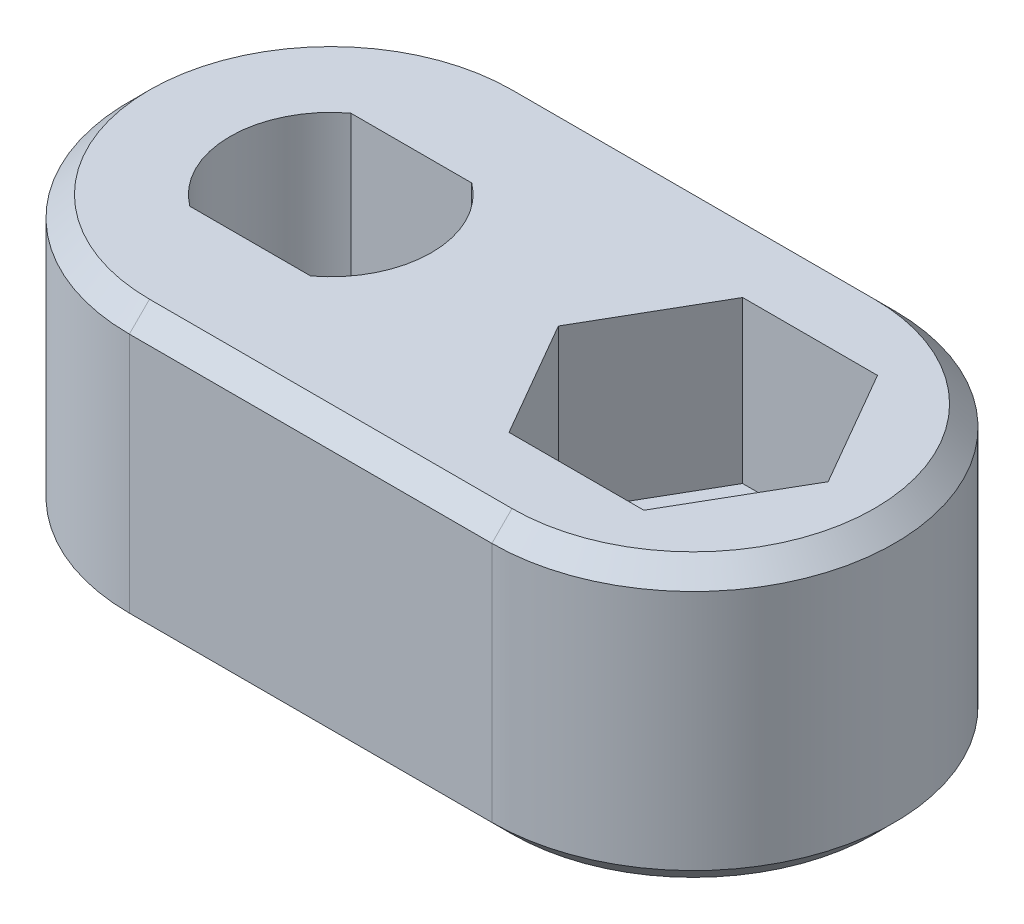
from build123d import *

# Parameters (mm, degrees)
EXTRUDE_1_DEPTH              = 7
CUT_EXTRUDE_1_DEPTH          = 4
HOLE_WIZARD_M3_1_D           = 3.4
HOLE_WIZARD_M3_1_DEPTH       = 7.5
HOLE_WIZARD_M3_1_CSINK_D     = 6.72
HOLE_WIZARD_M3_1_CSINK_ANGLE = 90
HOLE_WIZARD_M3_1_TIP         = 1.021463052
HOLE_WIZARD_1_D              = 4.15
CUT_EXTRUDE_2_DEPTH          = 4
CHAMFER_1_SIZE               = 0.5


with BuildPart() as part:
    # Sketch 1 → Extrude 1 (new body)
    with BuildSketch(Plane(origin=(0, 0, 0), x_dir=(1, 0, 0), z_dir=(0, 1, 0))):
        with BuildLine():
            Line((0, 5), (9, 5))
            ThreePointArc((9, 5), (14, 0), (9, -5))
            Line((9, -5), (0, -5))
            ThreePointArc((0, -5), (-5, 0), (0, 5))
        make_face()
    extrude(amount=EXTRUDE_1_DEPTH)

    # Sketch 2 → Cut-Extrude 1 (cut)
    with BuildSketch(Plane(origin=(0, 7, 0), x_dir=(1, 0, 0), z_dir=(0, 1, 0))):
        with BuildLine():
            ThreePointArc((-1.5, 2), (-2.5, 0), (-1.5, -2))
            Line((-1.5, -2), (1.5, -2))
            ThreePointArc((1.5, -2), (2.236067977, -1.118033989), (2.5, 0))
            ThreePointArc((2.5, 0), (2.236067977, 1.118033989), (1.5, 2))
            Line((1.5, 2), (-1.5, 2))
        make_face()
    extrude(amount=-CUT_EXTRUDE_1_DEPTH, mode=Mode.SUBTRACT)

    # Hole Wizard M3 _1
    with Locations(Plane(origin=(0, 0, 0), x_dir=(-1, 0, 0), z_dir=(0, -1, 0))):
        with Locations((0, 0)):
            CounterSinkHole(HOLE_WIZARD_M3_1_D / 2, HOLE_WIZARD_M3_1_CSINK_D / 2, depth=HOLE_WIZARD_M3_1_DEPTH, counter_sink_angle=HOLE_WIZARD_M3_1_CSINK_ANGLE)
            with Locations((0, 0, -(HOLE_WIZARD_M3_1_DEPTH + HOLE_WIZARD_M3_1_TIP / 2))):  # 118° drill point
                Cone(0, HOLE_WIZARD_M3_1_D / 2, HOLE_WIZARD_M3_1_TIP, mode=Mode.SUBTRACT)

    # Hole Wizard 1 (through all)
    with Locations(Plane(origin=(0, 0, 0), x_dir=(-1, 0, 0), z_dir=(0, -1, 0))):
        with Locations((-9, 0)):
            Hole(HOLE_WIZARD_1_D / 2)

    # Sketch 7 → Cut-Extrude 2 (cut)
    with BuildSketch(Plane(origin=(0, 7, 0), x_dir=(1, 0, 0), z_dir=(0, 1, 0))):
        Polygon((12.348631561, 0), (10.674315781, 2.9), (7.325684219, 2.9), (5.651368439, 0), (7.325684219, -2.9), (10.674315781, -2.9), align=None)
    extrude(amount=-CUT_EXTRUDE_2_DEPTH, mode=Mode.SUBTRACT)

    # Chamfer 1
    chamfer_1_edges = [part.edges().sort_by_distance(p)[0] for p in [
        (14, 7, 0),
        (4.5, 7, -5),
        (-5, 7, 0),
        (4.5, 0, -5),
        (14, 0, 0),
        (4.5, 0, 5),
        (-5, 0, 0),
        (4.5, 7, 5),
    ]]
    chamfer(chamfer_1_edges, length=CHAMFER_1_SIZE)


solid = part.part
